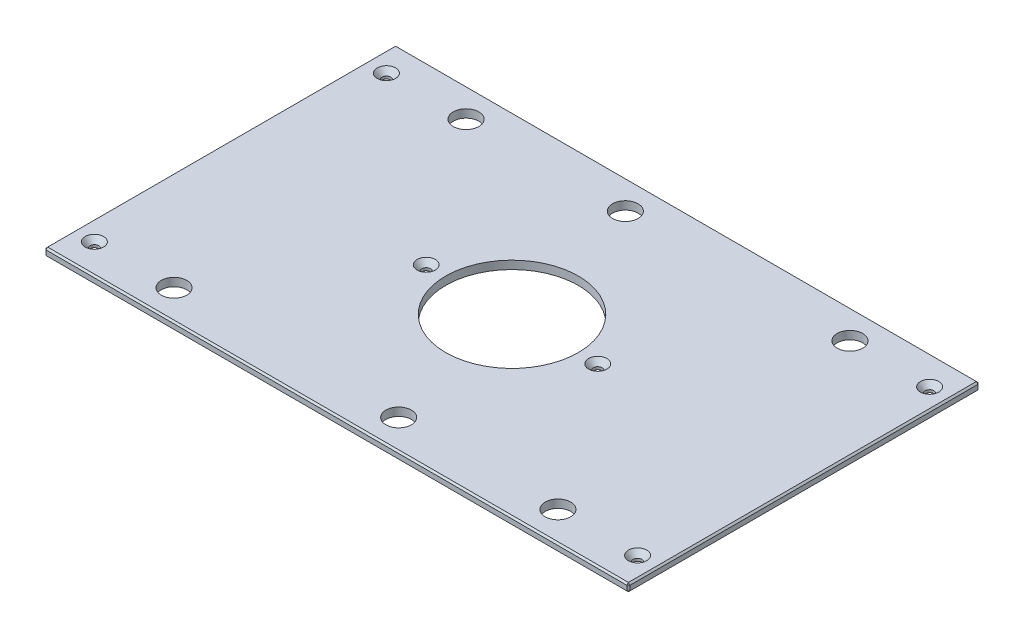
from build123d import *

# Parameters (mm, degrees)
SKETCH1_W                                     = 454.025
SKETCH1_H                                     = 273.05
BOSS_EXTRUDE1_DEPTH                           = 6.35
SKETCH13_R                                    = 51.562
CUT_EXTRUDE6_DEPTH                            = 265.979382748
F_25_32_0_78125_DIAMETER_HOLE1_D              = 19.84375
CHAMFER2_SIZE                                 = 1.27
CSK_FOR_1_4_FLAT_HEAD_MACHINE_SCREW1_AT_COUNT = 2
CSK_FOR_1_4_FLAT_HEAD_MACHINE_SCREW1_AT_PITCH = 227.00996
CSK_FOR_1_4_FLAT_HEAD_MACHINE_SCREW1_2_COUNT  = 2
CSK_FOR_1_4_FLAT_HEAD_MACHINE_SCREW1_2_PITCH  = 479.426425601
CSK_FOR_1_4_FLAT_HEAD_MACHINE_SCREW1_3_COUNT  = 2
CSK_FOR_1_4_FLAT_HEAD_MACHINE_SCREW1_3_PITCH  = 300.105257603
CSK_FOR_1_4_FLAT_HEAD_MACHINE_SCREW1_4_COUNT  = 2
CSK_FOR_1_4_FLAT_HEAD_MACHINE_SCREW1_4_PITCH  = 183.71933592
CSK_FOR_1_4_FLAT_HEAD_MACHINE_SCREW1_5_COUNT  = 2
CSK_FOR_1_4_FLAT_HEAD_MACHINE_SCREW1_5_PITCH  = 422.275
CSK_FOR_1_4_FLAT_HEAD_MACHINE_SCREW1_6_COUNT  = 2
CSK_FOR_1_4_FLAT_HEAD_MACHINE_SCREW1_6_PITCH  = 360.3625
CSK_FOR_1_4_FLAT_HEAD_MACHINE_SCREW1_7_COUNT  = 2
CSK_FOR_1_4_FLAT_HEAD_MACHINE_SCREW1_7_PITCH  = 425.904512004


with BuildPart() as part:
    # Sketch1 → Boss-Extrude1 (new body)
    with BuildSketch(Plane(origin=(0, 0, 0), x_dir=(1, 0, 0), z_dir=(0, 1, 0))):
        Rectangle(SKETCH1_W, SKETCH1_H)
    extrude(amount=BOSS_EXTRUDE1_DEPTH)

    # Sketch13 → Cut-Extrude6 (cut, through all)
    with BuildSketch(Plane(origin=(0, 6.35, 0), x_dir=(1, 0, 0), z_dir=(0, 1, 0))):
        with Locations(Location((0, 0, 0), (0, 0, 270))):
            Circle(SKETCH13_R)
    extrude(amount=-CUT_EXTRUDE6_DEPTH, mode=Mode.SUBTRACT)

    # 25_32 _0.78125_ Diameter Hole1 (through all)
    with Locations(Plane(origin=(0, 6.35, 0), x_dir=(1, 0, 0), z_dir=(0, 1, 0))):
        with Locations((149.225, 113.50498), (-149.225, 113.50498), (149.225, -113.50498), (-149.225, -113.50498), (-25.4, 113.50498), (25.4, -113.50498)):
            Hole(F_25_32_0_78125_DIAMETER_HOLE1_D / 2)

    # Chamfer2
    chamfer2_edges = [part.edges().sort_by_distance(p)[0] for p in [
        (227.0125, 6.35, 0),
        (0, 6.35, -136.525),
        (-227.0125, 6.35, 0),
        (0, 0, -136.525),
        (227.0125, 0, 0),
        (0, 0, 136.525),
        (-227.0125, 0, 0),
        (0, 6.35, 136.525),
        (-227.0125, 3.175, -136.525),
        (227.0125, 3.175, -136.525),
        (227.0125, 3.175, 136.525),
        (-227.0125, 3.175, 136.525),
    ]]
    chamfer(chamfer2_edges, length=CHAMFER2_SIZE)

    # Sketch24 → CSK for 1_4 Flat Head Machine Screw1 (revolve, cut)
    with BuildSketch(Plane(origin=(211.1375, 6.35, -113.50498), x_dir=(0, 0, 1), z_dir=(1, 0, 0))):
        Polygon((0, 0), (0, 6.35), (3.3782, 6.35), (3.3782, 4.324464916), (7.1374, 0), align=None)
    csk_for_1_4_flat_head_machine_screw1 = revolve(axis=Axis((211.1375, 12.7, -113.50498), (0, -1, 0)), mode=Mode.SUBTRACT)

    # CSK for 1_4 Flat Head Machine Screw1 at: CSK for 1_4 Flat Head Machine Screw1 ×2
    with Locations(*[(0, 0, i * CSK_FOR_1_4_FLAT_HEAD_MACHINE_SCREW1_AT_PITCH) for i in range(1, CSK_FOR_1_4_FLAT_HEAD_MACHINE_SCREW1_AT_COUNT)]):
        add(csk_for_1_4_flat_head_machine_screw1, mode=Mode.SUBTRACT)

    # CSK for 1_4 Flat Head Machine Screw1 2: CSK for 1_4 Flat Head Machine Screw1 ×2
    with Locations(*[Vector(-0.88079208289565, 0, 0.4735032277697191) * (i * CSK_FOR_1_4_FLAT_HEAD_MACHINE_SCREW1_2_PITCH) for i in range(1, CSK_FOR_1_4_FLAT_HEAD_MACHINE_SCREW1_2_COUNT)]):
        add(csk_for_1_4_flat_head_machine_screw1, mode=Mode.SUBTRACT)

    # CSK for 1_4 Flat Head Machine Screw1 3: CSK for 1_4 Flat Head Machine Screw1 ×2
    with Locations(*[Vector(-0.9257168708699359, 0, 0.37821723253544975) * (i * CSK_FOR_1_4_FLAT_HEAD_MACHINE_SCREW1_3_PITCH) for i in range(1, CSK_FOR_1_4_FLAT_HEAD_MACHINE_SCREW1_3_COUNT)]):
        add(csk_for_1_4_flat_head_machine_screw1, mode=Mode.SUBTRACT)

    # CSK for 1_4 Flat Head Machine Screw1 4: CSK for 1_4 Flat Head Machine Screw1 ×2
    with Locations(*[Vector(-0.7863216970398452, 0, 0.6178172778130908) * (i * CSK_FOR_1_4_FLAT_HEAD_MACHINE_SCREW1_4_PITCH) for i in range(1, CSK_FOR_1_4_FLAT_HEAD_MACHINE_SCREW1_4_COUNT)]):
        add(csk_for_1_4_flat_head_machine_screw1, mode=Mode.SUBTRACT)

    # CSK for 1_4 Flat Head Machine Screw1 5: CSK for 1_4 Flat Head Machine Screw1 ×2
    with Locations(*[(-i * CSK_FOR_1_4_FLAT_HEAD_MACHINE_SCREW1_5_PITCH, 0, 0) for i in range(1, CSK_FOR_1_4_FLAT_HEAD_MACHINE_SCREW1_5_COUNT)]):
        add(csk_for_1_4_flat_head_machine_screw1, mode=Mode.SUBTRACT)

    # CSK for 1_4 Flat Head Machine Screw1 6: CSK for 1_4 Flat Head Machine Screw1 ×2
    with Locations(*[(-i * CSK_FOR_1_4_FLAT_HEAD_MACHINE_SCREW1_6_PITCH, 0, 0) for i in range(1, CSK_FOR_1_4_FLAT_HEAD_MACHINE_SCREW1_6_COUNT)]):
        add(csk_for_1_4_flat_head_machine_screw1, mode=Mode.SUBTRACT)

    # CSK for 1_4 Flat Head Machine Screw1 7: CSK for 1_4 Flat Head Machine Screw1 ×2
    with Locations(*[Vector(-0.8461110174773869, 0, 0.5330067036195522) * (i * CSK_FOR_1_4_FLAT_HEAD_MACHINE_SCREW1_7_PITCH) for i in range(1, CSK_FOR_1_4_FLAT_HEAD_MACHINE_SCREW1_7_COUNT)]):
        add(csk_for_1_4_flat_head_machine_screw1, mode=Mode.SUBTRACT)


solid = part.part
